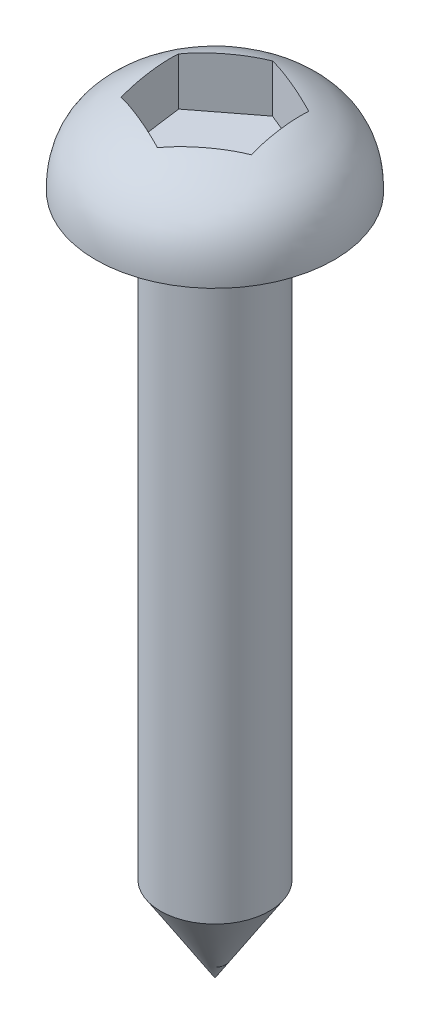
ISO-10303-21;
HEADER;
FILE_DESCRIPTION(('STEP AP214'),'2;1');
FILE_NAME('part.step','',(''),(''),'','','');
FILE_SCHEMA(('AUTOMOTIVE_DESIGN { 1 0 10303 214 1 1 1 1 }'));
ENDSEC;
DATA;
#1=APPLICATION_CONTEXT('core data for automotive mechanical design processes');
#2=APPLICATION_PROTOCOL_DEFINITION('international standard','automotive_design',2000,#1);
#3=PRODUCT_CONTEXT('',#1,'mechanical');
#4=PRODUCT('Part','Part','',(#3));
#5=PRODUCT_RELATED_PRODUCT_CATEGORY('part','',(#4));
#6=PRODUCT_DEFINITION_FORMATION('','',#4);
#7=PRODUCT_DEFINITION_CONTEXT('part definition',#1,'design');
#8=PRODUCT_DEFINITION('design','',#6,#7);
#9=PRODUCT_DEFINITION_SHAPE('','',#8);
#10=(LENGTH_UNIT() NAMED_UNIT(*) SI_UNIT(.MILLI.,.METRE.));
#11=(NAMED_UNIT(*) PLANE_ANGLE_UNIT() SI_UNIT($,.RADIAN.));
#12=(NAMED_UNIT(*) SI_UNIT($,.STERADIAN.) SOLID_ANGLE_UNIT());
#13=UNCERTAINTY_MEASURE_WITH_UNIT(LENGTH_MEASURE(1.E-05),#10,'distance_accuracy_value','');
#14=(GEOMETRIC_REPRESENTATION_CONTEXT(3) GLOBAL_UNCERTAINTY_ASSIGNED_CONTEXT((#13)) GLOBAL_UNIT_ASSIGNED_CONTEXT((#10,
#11,#12)) REPRESENTATION_CONTEXT('',''));
#15=CARTESIAN_POINT('',(0.,0.,0.));
#16=DIRECTION('',(0.,0.,1.));
#17=DIRECTION('',(1.,0.,0.));
#18=AXIS2_PLACEMENT_3D('',#15,#16,#17);
#19=CARTESIAN_POINT('',(0.,8.85,0.));
#20=CARTESIAN_POINT('',(-1.23672619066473,8.83535604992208,0.));
#21=CARTESIAN_POINT('',(-1.69469219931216,8.77485583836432,0.));
#22=CARTESIAN_POINT('',(-2.83177027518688,8.13342718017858,0.));
#23=CARTESIAN_POINT('',(-3.51361897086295,7.67125323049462,0.));
#24=CARTESIAN_POINT('',(-3.5,6.4,0.));
#25=B_SPLINE_CURVE_WITH_KNOTS('',3,(#19,#20,#21,#22,#23,#24),.UNSPECIFIED.,.F.,.F.,(4,2,4),(0.,
0.508645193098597,1.),.UNSPECIFIED.);
#26=CARTESIAN_POINT('',(0.,9.43427916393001,0.));
#27=DIRECTION('',(0.,1.,0.));
#28=AXIS1_PLACEMENT('',#26,#27);
#29=SURFACE_OF_REVOLUTION('',#25,#28);
#30=CARTESIAN_POINT('',(0.,6.4,0.));
#31=DIRECTION('',(0.,1.,0.));
#32=DIRECTION('',(0.,0.,1.));
#33=AXIS2_PLACEMENT_3D('',#30,#31,#32);
#34=CIRCLE('',#33,3.5);
#35=CARTESIAN_POINT('',(0.,6.4,3.5));
#36=VERTEX_POINT('',#35);
#37=EDGE_CURVE('E98',#36,#36,#34,.T.);
#38=ORIENTED_EDGE('',*,*,#37,.T.);
#39=EDGE_LOOP('',(#38));
#40=FACE_BOUND('',#39,.T.);
#41=CARTESIAN_POINT('',(1.55623644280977,8.60199665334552,-1.19643698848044));
#42=CARTESIAN_POINT('',(1.56161786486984,8.61058086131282,-1.15585192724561));
#43=CARTESIAN_POINT('',(1.56701811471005,8.61846530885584,-1.11512487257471));
#44=CARTESIAN_POINT('',(1.57784651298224,8.63291595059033,-1.03346036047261));
#45=CARTESIAN_POINT('',(1.58327464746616,8.63948274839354,-0.99252300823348));
#46=CARTESIAN_POINT('',(1.59412865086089,8.651359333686,-0.910665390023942));
#47=CARTESIAN_POINT('',(1.59955441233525,8.65667483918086,-0.869745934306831));
#48=CARTESIAN_POINT('',(1.61042420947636,8.66617720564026,-0.787769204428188));
#49=CARTESIAN_POINT('',(1.61586824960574,8.67036376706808,-0.746711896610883));
#50=CARTESIAN_POINT('',(1.63728895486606,8.68478112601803,-0.585163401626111));
#51=CARTESIAN_POINT('',(1.65331280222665,8.69108057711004,-0.46431638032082));
#52=CARTESIAN_POINT('',(1.68538240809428,8.6961333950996,-0.22245709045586));
#53=CARTESIAN_POINT('',(1.70142817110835,8.69488485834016,-0.101444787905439));
#54=CARTESIAN_POINT('',(1.72557781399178,8.68707310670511,0.0806845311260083));
#55=CARTESIAN_POINT('',(1.73369878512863,8.68343211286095,0.14193044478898));
#56=CARTESIAN_POINT('',(1.74991746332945,8.67391492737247,0.264246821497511));
#57=CARTESIAN_POINT('',(1.75801517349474,8.66803904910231,0.32531730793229));
#58=CARTESIAN_POINT('',(1.77417212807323,8.65378833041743,0.447168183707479));
#59=CARTESIAN_POINT('',(1.78223137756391,8.64541382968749,0.50794861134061));
#60=CARTESIAN_POINT('',(1.79829487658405,8.62587251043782,0.629094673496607));
#61=CARTESIAN_POINT('',(1.80629909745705,8.61470433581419,0.689460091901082));
#62=CARTESIAN_POINT('',(1.81426304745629,8.60199665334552,0.749521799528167));
#63=B_SPLINE_CURVE_WITH_KNOTS('',3,(#41,#42,#43,#44,#45,#46,#47,#48,#49,#50,#51,#52,#53,#54,#55,
#56,#57,#58,#59,#60,#61,#62),.UNSPECIFIED.,.F.,.F.,(4,2,2,2,2,2,2,2,2,2,4),(0.,
0.125480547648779,0.250903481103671,0.375741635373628,0.500612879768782,0.866512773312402,
1.23250495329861,1.41813964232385,1.60374831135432,1.78933175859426,1.97500546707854),.UNSPECIFIED.);
#64=CARTESIAN_POINT('',(1.55623644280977,8.60199665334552,-1.19643698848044));
#65=VERTEX_POINT('',#64);
#66=CARTESIAN_POINT('',(1.81426304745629,8.60199665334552,0.749521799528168));
#67=VERTEX_POINT('',#66);
#68=EDGE_CURVE('E45',#65,#67,#63,.T.);
#69=ORIENTED_EDGE('',*,*,#68,.T.);
#70=CARTESIAN_POINT('',(1.8142630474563,8.60199665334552,0.749521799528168));
#71=CARTESIAN_POINT('',(1.78180606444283,8.61058086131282,0.774474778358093));
#72=CARTESIAN_POINT('',(1.74923552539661,8.61846530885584,0.799515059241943));
#73=CARTESIAN_POINT('',(1.68392618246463,8.63291595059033,0.849724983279));
#74=CARTESIAN_POINT('',(1.65118746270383,8.63948274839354,0.874894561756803));
#75=CARTESIAN_POINT('',(1.58572368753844,8.651359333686,0.925223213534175));
#76=CARTESIAN_POINT('',(1.55299928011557,8.65667483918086,0.950381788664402));
#77=CARTESIAN_POINT('',(1.48744024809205,8.66617720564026,1.00078367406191));
#78=CARTESIAN_POINT('',(1.45460559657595,8.67036376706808,1.02602700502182));
#79=CARTESIAN_POINT('',(1.32541084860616,8.68478112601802,1.12535212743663));
#80=CARTESIAN_POINT('',(1.22876618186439,8.69108057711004,1.19965269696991));
#81=CARTESIAN_POINT('',(1.03534469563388,8.6961333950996,1.34835543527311));
#82=CARTESIAN_POINT('',(0.938567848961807,8.69488485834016,1.42275762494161));
#83=CARTESIAN_POINT('',(0.792914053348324,8.68707310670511,1.53473648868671));
#84=CARTESIAN_POINT('',(0.74393402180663,8.68343211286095,1.57239241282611));
#85=CARTESIAN_POINT('',(0.646114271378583,8.67391492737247,1.64759638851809));
#86=CARTESIAN_POINT('',(0.597274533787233,8.66803904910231,1.6851444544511));
#87=CARTESIAN_POINT('',(0.499827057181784,8.65378833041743,1.76006222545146));
#88=CARTESIAN_POINT('',(0.45121928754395,8.64541382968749,1.79743195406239));
#89=CARTESIAN_POINT('',(0.354335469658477,8.62587251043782,1.8719163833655));
#90=CARTESIAN_POINT('',(0.306059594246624,8.61470433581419,1.90903095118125));
#91=CARTESIAN_POINT('',(0.258026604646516,8.60199665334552,1.94595878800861));
#92=B_SPLINE_CURVE_WITH_KNOTS('',3,(#70,#71,#72,#73,#74,#75,#76,#77,#78,#79,#80,#81,#82,#83,#84,
#85,#86,#87,#88,#89,#90,#91),.UNSPECIFIED.,.F.,.F.,(4,2,2,2,2,2,2,2,2,2,4),(0.,0.12548054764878,
0.250903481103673,0.375741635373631,0.500612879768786,0.866512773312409,1.23250495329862,
1.41813964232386,1.60374831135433,1.78933175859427,1.97500546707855),.UNSPECIFIED.);
#93=CARTESIAN_POINT('',(0.258026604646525,8.60199665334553,1.9459587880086));
#94=VERTEX_POINT('',#93);
#95=EDGE_CURVE('E11',#67,#94,#92,.T.);
#96=ORIENTED_EDGE('',*,*,#95,.T.);
#97=CARTESIAN_POINT('',(0.25802660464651,8.60199665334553,1.9459587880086));
#98=CARTESIAN_POINT('',(0.220188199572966,8.61058086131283,1.9303267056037));
#99=CARTESIAN_POINT('',(0.182217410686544,8.61846530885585,1.91463993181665));
#100=CARTESIAN_POINT('',(0.106079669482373,8.63291595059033,1.88318534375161));
#101=CARTESIAN_POINT('',(0.0679128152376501,8.63948274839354,1.86741756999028));
#102=CARTESIAN_POINT('',(-0.00840496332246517,8.65135933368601,1.83588860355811));
#103=CARTESIAN_POINT('',(-0.0465551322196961,8.65667483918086,1.82012772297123));
#104=CARTESIAN_POINT('',(-0.12298396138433,8.66617720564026,1.78855287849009));
#105=CARTESIAN_POINT('',(-0.1612626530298,8.67036376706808,1.7727389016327));
#106=CARTESIAN_POINT('',(-0.311878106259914,8.68478112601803,1.71051552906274));
#107=CARTESIAN_POINT('',(-0.424546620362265,8.69108057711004,1.66396907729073));
#108=CARTESIAN_POINT('',(-0.650037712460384,8.69613339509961,1.57081252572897));
#109=CARTESIAN_POINT('',(-0.762860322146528,8.69488485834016,1.52420241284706));
#110=CARTESIAN_POINT('',(-0.932663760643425,8.68707310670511,1.4540519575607));
#111=CARTESIAN_POINT('',(-0.989764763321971,8.68343211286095,1.43046196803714));
#112=CARTESIAN_POINT('',(-1.10380319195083,8.67391492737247,1.38334956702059));
#113=CARTESIAN_POINT('',(-1.16074063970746,8.66803904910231,1.35982714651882));
#114=CARTESIAN_POINT('',(-1.2743450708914,8.65378833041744,1.31289404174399));
#115=CARTESIAN_POINT('',(-1.3310120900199,8.6454138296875,1.2894833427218));
#116=CARTESIAN_POINT('',(-1.44395940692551,8.62587251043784,1.24282170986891));
#117=CARTESIAN_POINT('',(-1.50023950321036,8.6147043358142,1.21957085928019));
#118=CARTESIAN_POINT('',(-1.55623644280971,8.60199665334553,1.19643698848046));
#119=B_SPLINE_CURVE_WITH_KNOTS('',3,(#97,#98,#99,#100,#101,#102,#103,#104,#105,#106,#107,#108,
#109,#110,#111,#112,#113,#114,#115,#116,#117,#118),.UNSPECIFIED.,.F.,.F.,(4,2,2,2,2,2,2,2,2,2,
4),(0.,0.125480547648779,0.250903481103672,0.375741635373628,0.500612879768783,
0.866512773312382,1.23250495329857,1.4181396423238,1.60374831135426,1.78933175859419,
1.97500546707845),.UNSPECIFIED.);
#120=CARTESIAN_POINT('',(-1.5562364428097,8.60199665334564,1.19643698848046));
#121=VERTEX_POINT('',#120);
#122=EDGE_CURVE('E148',#94,#121,#119,.T.);
#123=ORIENTED_EDGE('',*,*,#122,.T.);
#124=CARTESIAN_POINT('',(-1.5562364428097,8.60199665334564,1.19643698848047));
#125=CARTESIAN_POINT('',(-1.56161786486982,8.61058086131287,1.15585192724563));
#126=CARTESIAN_POINT('',(-1.56701811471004,8.61846530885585,1.11512487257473));
#127=CARTESIAN_POINT('',(-1.57784651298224,8.63291595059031,1.03346036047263));
#128=CARTESIAN_POINT('',(-1.58327464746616,8.63948274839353,0.992523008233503));
#129=CARTESIAN_POINT('',(-1.59412865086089,8.651359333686,0.910665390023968));
#130=CARTESIAN_POINT('',(-1.59955441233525,8.65667483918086,0.869745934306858));
#131=CARTESIAN_POINT('',(-1.61042420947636,8.66617720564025,0.787769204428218));
#132=CARTESIAN_POINT('',(-1.61586824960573,8.67036376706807,0.746711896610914));
#133=CARTESIAN_POINT('',(-1.63728895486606,8.68478112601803,0.585163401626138));
#134=CARTESIAN_POINT('',(-1.65331280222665,8.69108057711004,0.464316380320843));
#135=CARTESIAN_POINT('',(-1.68538240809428,8.6961333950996,0.222457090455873));
#136=CARTESIAN_POINT('',(-1.70142817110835,8.69488485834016,0.101444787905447));
#137=CARTESIAN_POINT('',(-1.72557781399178,8.68707310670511,-0.0806845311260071));
#138=CARTESIAN_POINT('',(-1.73369878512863,8.68343211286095,-0.14193044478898));
#139=CARTESIAN_POINT('',(-1.74991746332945,8.67391492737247,-0.264246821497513));
#140=CARTESIAN_POINT('',(-1.75801517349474,8.66803904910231,-0.325317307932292));
#141=CARTESIAN_POINT('',(-1.77417212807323,8.65378833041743,-0.447168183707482));
#142=CARTESIAN_POINT('',(-1.78223137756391,8.64541382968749,-0.507948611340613));
#143=CARTESIAN_POINT('',(-1.79829487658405,8.62587251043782,-0.629094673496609));
#144=CARTESIAN_POINT('',(-1.80629909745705,8.61470433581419,-0.689460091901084));
#145=CARTESIAN_POINT('',(-1.81426304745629,8.60199665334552,-0.749521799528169));
#146=B_SPLINE_CURVE_WITH_KNOTS('',3,(#124,#125,#126,#127,#128,#129,#130,#131,#132,#133,#134,
#135,#136,#137,#138,#139,#140,#141,#142,#143,#144,#145),.UNSPECIFIED.,.F.,.F.,(4,2,2,2,2,2,2,2,
2,2,4),(0.,0.125480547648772,0.250903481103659,0.375741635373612,0.500612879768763,
0.866512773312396,1.23250495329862,1.41813964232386,1.60374831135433,1.78933175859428,
1.97500546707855),.UNSPECIFIED.);
#147=CARTESIAN_POINT('',(-1.81426304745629,8.60199665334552,-0.749521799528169));
#148=VERTEX_POINT('',#147);
#149=EDGE_CURVE('E157',#121,#148,#146,.T.);
#150=ORIENTED_EDGE('',*,*,#149,.T.);
#151=CARTESIAN_POINT('',(-1.81426304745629,8.60199665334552,-0.74952179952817));
#152=CARTESIAN_POINT('',(-1.78180606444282,8.61058086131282,-0.774474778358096));
#153=CARTESIAN_POINT('',(-1.74923552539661,8.61846530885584,-0.799515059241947));
#154=CARTESIAN_POINT('',(-1.68392618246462,8.63291595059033,-0.849724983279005));
#155=CARTESIAN_POINT('',(-1.65118746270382,8.63948274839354,-0.874894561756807));
#156=CARTESIAN_POINT('',(-1.58572368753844,8.651359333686,-0.92522321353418));
#157=CARTESIAN_POINT('',(-1.55299928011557,8.65667483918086,-0.950381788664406));
#158=CARTESIAN_POINT('',(-1.48744024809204,8.66617720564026,-1.00078367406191));
#159=CARTESIAN_POINT('',(-1.45460559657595,8.67036376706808,-1.02602700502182));
#160=CARTESIAN_POINT('',(-1.32541084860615,8.68478112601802,-1.12535212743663));
#161=CARTESIAN_POINT('',(-1.22876618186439,8.69108057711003,-1.19965269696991));
#162=CARTESIAN_POINT('',(-1.03534469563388,8.6961333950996,-1.34835543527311));
#163=CARTESIAN_POINT('',(-0.938567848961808,8.69488485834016,-1.42275762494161));
#164=CARTESIAN_POINT('',(-0.792914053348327,8.68707310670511,-1.5347364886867));
#165=CARTESIAN_POINT('',(-0.743934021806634,8.68343211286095,-1.57239241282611));
#166=CARTESIAN_POINT('',(-0.646114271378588,8.67391492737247,-1.64759638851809));
#167=CARTESIAN_POINT('',(-0.597274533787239,8.66803904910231,-1.68514445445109));
#168=CARTESIAN_POINT('',(-0.499827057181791,8.65378833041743,-1.76006222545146));
#169=CARTESIAN_POINT('',(-0.451219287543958,8.64541382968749,-1.79743195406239));
#170=CARTESIAN_POINT('',(-0.354335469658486,8.62587251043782,-1.87191638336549));
#171=CARTESIAN_POINT('',(-0.306059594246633,8.61470433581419,-1.90903095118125));
#172=CARTESIAN_POINT('',(-0.258026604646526,8.60199665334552,-1.94595878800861));
#173=B_SPLINE_CURVE_WITH_KNOTS('',3,(#151,#152,#153,#154,#155,#156,#157,#158,#159,#160,#161,
#162,#163,#164,#165,#166,#167,#168,#169,#170,#171,#172),.UNSPECIFIED.,.F.,.F.,(4,2,2,2,2,2,2,2,
2,2,4),(0.,0.12548054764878,0.250903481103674,0.375741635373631,0.500612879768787,
0.866512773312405,1.23250495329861,1.41813964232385,1.60374831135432,1.78933175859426,
1.97500546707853),.UNSPECIFIED.);
#174=CARTESIAN_POINT('',(-0.258026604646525,8.60199665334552,-1.94595878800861));
#175=VERTEX_POINT('',#174);
#176=EDGE_CURVE('E164',#148,#175,#173,.T.);
#177=ORIENTED_EDGE('',*,*,#176,.T.);
#178=CARTESIAN_POINT('',(-0.258026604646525,8.60199665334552,-1.94595878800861));
#179=CARTESIAN_POINT('',(-0.22018819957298,8.61058086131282,-1.93032670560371));
#180=CARTESIAN_POINT('',(-0.182217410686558,8.61846530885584,-1.91463993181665));
#181=CARTESIAN_POINT('',(-0.106079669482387,8.63291595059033,-1.88318534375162));
#182=CARTESIAN_POINT('',(-0.0679128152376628,8.63948274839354,-1.86741756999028));
#183=CARTESIAN_POINT('',(0.00840496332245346,8.651359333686,-1.83588860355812));
#184=CARTESIAN_POINT('',(0.0465551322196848,8.65667483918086,-1.82012772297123));
#185=CARTESIAN_POINT('',(0.122983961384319,8.66617720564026,-1.78855287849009));
#186=CARTESIAN_POINT('',(0.161262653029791,8.67036376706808,-1.7727389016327));
#187=CARTESIAN_POINT('',(0.311878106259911,8.68478112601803,-1.71051552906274));
#188=CARTESIAN_POINT('',(0.424546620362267,8.69108057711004,-1.66396907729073));
#189=CARTESIAN_POINT('',(0.650037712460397,8.69613339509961,-1.57081252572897));
#190=CARTESIAN_POINT('',(0.762860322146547,8.69488485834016,-1.52420241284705));
#191=CARTESIAN_POINT('',(0.932663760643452,8.68707310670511,-1.45405195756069));
#192=CARTESIAN_POINT('',(0.989764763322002,8.68343211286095,-1.43046196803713));
#193=CARTESIAN_POINT('',(1.10380319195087,8.67391492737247,-1.38334956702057));
#194=CARTESIAN_POINT('',(1.1607406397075,8.66803904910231,-1.3598271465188));
#195=CARTESIAN_POINT('',(1.27434507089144,8.65378833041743,-1.31289404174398));
#196=CARTESIAN_POINT('',(1.33101209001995,8.64541382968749,-1.28948334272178));
#197=CARTESIAN_POINT('',(1.44395940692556,8.62587251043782,-1.24282170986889));
#198=CARTESIAN_POINT('',(1.50023950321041,8.61470433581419,-1.21957085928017));
#199=CARTESIAN_POINT('',(1.55623644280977,8.60199665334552,-1.19643698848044));
#200=B_SPLINE_CURVE_WITH_KNOTS('',3,(#178,#179,#180,#181,#182,#183,#184,#185,#186,#187,#188,
#189,#190,#191,#192,#193,#194,#195,#196,#197,#198,#199),.UNSPECIFIED.,.F.,.F.,(4,2,2,2,2,2,2,2,
2,2,4),(0.,0.125480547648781,0.250903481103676,0.375741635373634,0.50061287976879,
0.866512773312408,1.23250495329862,1.41813964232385,1.60374831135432,1.78933175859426,
1.97500546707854),.UNSPECIFIED.);
#201=EDGE_CURVE('E170',#175,#65,#200,.T.);
#202=ORIENTED_EDGE('',*,*,#201,.T.);
#203=EDGE_LOOP('',(#69,#96,#123,#150,#177,#202));
#204=FACE_BOUND('',#203,.T.);
#205=ADVANCED_FACE('F32',(#40,#204),#29,.F.);
#206=CARTESIAN_POINT('',(0.,-13.6,0.));
#207=DIRECTION('',(0.,1.,0.));
#208=DIRECTION('',(0.,0.,1.));
#209=AXIS2_PLACEMENT_3D('',#206,#207,#208);
#210=CYLINDRICAL_SURFACE('',#209,1.6);
#211=CARTESIAN_POINT('',(0.,-11.1,0.));
#212=DIRECTION('',(0.,1.,0.));
#213=DIRECTION('',(0.,0.,1.));
#214=AXIS2_PLACEMENT_3D('',#211,#212,#213);
#215=CIRCLE('',#214,1.6);
#216=CARTESIAN_POINT('',(0.,-11.1,1.6));
#217=VERTEX_POINT('',#216);
#218=EDGE_CURVE('E195',#217,#217,#215,.T.);
#219=ORIENTED_EDGE('',*,*,#218,.T.);
#220=EDGE_LOOP('',(#219));
#221=FACE_BOUND('',#220,.T.);
#222=CARTESIAN_POINT('',(0.,6.4,0.));
#223=DIRECTION('',(0.,1.,0.));
#224=DIRECTION('',(0.,0.,1.));
#225=AXIS2_PLACEMENT_3D('',#222,#223,#224);
#226=CIRCLE('',#225,1.6);
#227=CARTESIAN_POINT('',(0.,6.4,1.6));
#228=VERTEX_POINT('',#227);
#229=EDGE_CURVE('E197',#228,#228,#226,.T.);
#230=ORIENTED_EDGE('',*,*,#229,.F.);
#231=EDGE_LOOP('',(#230));
#232=FACE_BOUND('',#231,.T.);
#233=ADVANCED_FACE('F142',(#221,#232),#210,.T.);
#234=CARTESIAN_POINT('',(0.,6.4,0.));
#235=DIRECTION('',(0.,-1.,0.));
#236=DIRECTION('',(0.,0.,-1.));
#237=AXIS2_PLACEMENT_3D('',#234,#235,#236);
#238=PLANE('',#237);
#239=ORIENTED_EDGE('',*,*,#229,.T.);
#240=EDGE_LOOP('',(#239));
#241=FACE_BOUND('',#240,.T.);
#242=ORIENTED_EDGE('',*,*,#37,.F.);
#243=EDGE_LOOP('',(#242));
#244=FACE_BOUND('',#243,.T.);
#245=ADVANCED_FACE('F144',(#241,#244),#238,.T.);
#246=CARTESIAN_POINT('',(0.,-11.1,0.));
#247=DIRECTION('',(0.,1.,0.));
#248=DIRECTION('',(0.,0.,1.));
#249=AXIS2_PLACEMENT_3D('',#246,#247,#248);
#250=CONICAL_SURFACE('',#249,1.6,0.56931319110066);
#251=CARTESIAN_POINT('',(0.,-13.6,0.));
#252=VERTEX_POINT('',#251);
#253=VERTEX_LOOP('',#252);
#254=FACE_BOUND('',#253,.T.);
#255=ORIENTED_EDGE('',*,*,#218,.F.);
#256=EDGE_LOOP('',(#255));
#257=FACE_BOUND('',#256,.T.);
#258=ADVANCED_FACE('F34',(#254,#257),#250,.T.);
#259=CARTESIAN_POINT('',(0.258026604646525,9.2,1.9459587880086));
#260=DIRECTION('',(-0.609496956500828,0.,-0.792788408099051));
#261=DIRECTION('',(-0.792788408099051,0.,0.609496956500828));
#262=AXIS2_PLACEMENT_3D('',#259,#260,#261);
#263=PLANE('',#262);
#264=DIRECTION('',(0.,-1.,0.));
#265=VECTOR('',#264,1.);
#266=CARTESIAN_POINT('',(1.81426304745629,9.2,0.749521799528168));
#267=LINE('',#266,#265);
#268=CARTESIAN_POINT('',(1.81426304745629,7.2,0.749521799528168));
#269=VERTEX_POINT('',#268);
#270=EDGE_CURVE('E90',#67,#269,#267,.T.);
#271=ORIENTED_EDGE('',*,*,#270,.T.);
#272=DIRECTION('',(0.792788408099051,0.,-0.609496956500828));
#273=VECTOR('',#272,1.);
#274=CARTESIAN_POINT('',(0.258026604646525,7.2,1.9459587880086));
#275=LINE('',#274,#273);
#276=CARTESIAN_POINT('',(0.258026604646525,7.2,1.9459587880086));
#277=VERTEX_POINT('',#276);
#278=EDGE_CURVE('E95',#277,#269,#275,.T.);
#279=ORIENTED_EDGE('',*,*,#278,.F.);
#280=DIRECTION('',(0.,-1.,0.));
#281=VECTOR('',#280,1.);
#282=CARTESIAN_POINT('',(0.258026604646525,9.2,1.9459587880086));
#283=LINE('',#282,#281);
#284=EDGE_CURVE('E123',#94,#277,#283,.T.);
#285=ORIENTED_EDGE('',*,*,#284,.F.);
#286=ORIENTED_EDGE('',*,*,#95,.F.);
#287=EDGE_LOOP('',(#271,#279,#285,#286));
#288=FACE_BOUND('',#287,.T.);
#289=ADVANCED_FACE('F92',(#288),#263,.T.);
#290=CARTESIAN_POINT('',(1.81426304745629,9.2,0.749521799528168));
#291=DIRECTION('',(-0.991323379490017,0.,0.131445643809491));
#292=DIRECTION('',(0.131445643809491,0.,0.991323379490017));
#293=AXIS2_PLACEMENT_3D('',#290,#291,#292);
#294=PLANE('',#293);
#295=DIRECTION('',(0.,-1.,0.));
#296=VECTOR('',#295,1.);
#297=CARTESIAN_POINT('',(1.55623644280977,9.2,-1.19643698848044));
#298=LINE('',#297,#296);
#299=CARTESIAN_POINT('',(1.55623644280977,7.2,-1.19643698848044));
#300=VERTEX_POINT('',#299);
#301=EDGE_CURVE('E99',#65,#300,#298,.T.);
#302=ORIENTED_EDGE('',*,*,#301,.T.);
#303=DIRECTION('',(-0.131445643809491,0.,-0.991323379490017));
#304=VECTOR('',#303,1.);
#305=CARTESIAN_POINT('',(1.81426304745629,7.2,0.749521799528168));
#306=LINE('',#305,#304);
#307=EDGE_CURVE('E102',#269,#300,#306,.T.);
#308=ORIENTED_EDGE('',*,*,#307,.F.);
#309=ORIENTED_EDGE('',*,*,#270,.F.);
#310=ORIENTED_EDGE('',*,*,#68,.F.);
#311=EDGE_LOOP('',(#302,#308,#309,#310));
#312=FACE_BOUND('',#311,.T.);
#313=ADVANCED_FACE('F103',(#312),#294,.T.);
#314=CARTESIAN_POINT('',(1.55623644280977,9.2,-1.19643698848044));
#315=DIRECTION('',(-0.381826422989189,0.,0.924234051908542));
#316=DIRECTION('',(0.924234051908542,0.,0.381826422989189));
#317=AXIS2_PLACEMENT_3D('',#314,#315,#316);
#318=PLANE('',#317);
#319=DIRECTION('',(0.,-1.,0.));
#320=VECTOR('',#319,1.);
#321=CARTESIAN_POINT('',(-0.258026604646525,9.2,-1.94595878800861));
#322=LINE('',#321,#320);
#323=CARTESIAN_POINT('',(-0.258026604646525,7.2,-1.94595878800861));
#324=VERTEX_POINT('',#323);
#325=EDGE_CURVE('E128',#175,#324,#322,.T.);
#326=ORIENTED_EDGE('',*,*,#325,.T.);
#327=DIRECTION('',(-0.924234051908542,0.,-0.381826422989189));
#328=VECTOR('',#327,1.);
#329=CARTESIAN_POINT('',(1.55623644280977,7.2,-1.19643698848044));
#330=LINE('',#329,#328);
#331=EDGE_CURVE('E108',#300,#324,#330,.T.);
#332=ORIENTED_EDGE('',*,*,#331,.F.);
#333=ORIENTED_EDGE('',*,*,#301,.F.);
#334=ORIENTED_EDGE('',*,*,#201,.F.);
#335=EDGE_LOOP('',(#326,#332,#333,#334));
#336=FACE_BOUND('',#335,.T.);
#337=ADVANCED_FACE('F181',(#336),#318,.T.);
#338=CARTESIAN_POINT('',(-0.258026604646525,9.2,-1.94595878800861));
#339=DIRECTION('',(0.609496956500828,0.,0.792788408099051));
#340=DIRECTION('',(0.792788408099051,0.,-0.609496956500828));
#341=AXIS2_PLACEMENT_3D('',#338,#339,#340);
#342=PLANE('',#341);
#343=DIRECTION('',(0.,-1.,0.));
#344=VECTOR('',#343,1.);
#345=CARTESIAN_POINT('',(-1.81426304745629,9.2,-0.749521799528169));
#346=LINE('',#345,#344);
#347=CARTESIAN_POINT('',(-1.81426304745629,7.2,-0.749521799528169));
#348=VERTEX_POINT('',#347);
#349=EDGE_CURVE('E126',#148,#348,#346,.T.);
#350=ORIENTED_EDGE('',*,*,#349,.T.);
#351=DIRECTION('',(-0.792788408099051,0.,0.609496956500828));
#352=VECTOR('',#351,1.);
#353=CARTESIAN_POINT('',(-0.258026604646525,7.2,-1.94595878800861));
#354=LINE('',#353,#352);
#355=EDGE_CURVE('E117',#324,#348,#354,.T.);
#356=ORIENTED_EDGE('',*,*,#355,.F.);
#357=ORIENTED_EDGE('',*,*,#325,.F.);
#358=ORIENTED_EDGE('',*,*,#176,.F.);
#359=EDGE_LOOP('',(#350,#356,#357,#358));
#360=FACE_BOUND('',#359,.T.);
#361=ADVANCED_FACE('F212',(#360),#342,.T.);
#362=CARTESIAN_POINT('',(-1.81426304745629,9.2,-0.749521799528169));
#363=DIRECTION('',(0.991323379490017,0.,-0.131445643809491));
#364=DIRECTION('',(-0.131445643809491,0.,-0.991323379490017));
#365=AXIS2_PLACEMENT_3D('',#362,#363,#364);
#366=PLANE('',#365);
#367=DIRECTION('',(0.,-1.,0.));
#368=VECTOR('',#367,1.);
#369=CARTESIAN_POINT('',(-1.55623644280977,9.2,1.19643698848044));
#370=LINE('',#369,#368);
#371=CARTESIAN_POINT('',(-1.55623644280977,7.2,1.19643698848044));
#372=VERTEX_POINT('',#371);
#373=EDGE_CURVE('E52',#121,#372,#370,.T.);
#374=ORIENTED_EDGE('',*,*,#373,.T.);
#375=DIRECTION('',(0.131445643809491,0.,0.991323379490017));
#376=VECTOR('',#375,1.);
#377=CARTESIAN_POINT('',(-1.81426304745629,7.2,-0.749521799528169));
#378=LINE('',#377,#376);
#379=EDGE_CURVE('E120',#348,#372,#378,.T.);
#380=ORIENTED_EDGE('',*,*,#379,.F.);
#381=ORIENTED_EDGE('',*,*,#349,.F.);
#382=ORIENTED_EDGE('',*,*,#149,.F.);
#383=EDGE_LOOP('',(#374,#380,#381,#382));
#384=FACE_BOUND('',#383,.T.);
#385=ADVANCED_FACE('F216',(#384),#366,.T.);
#386=CARTESIAN_POINT('',(-1.55623644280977,9.2,1.19643698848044));
#387=DIRECTION('',(0.381826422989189,0.,-0.924234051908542));
#388=DIRECTION('',(-0.924234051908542,0.,-0.381826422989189));
#389=AXIS2_PLACEMENT_3D('',#386,#387,#388);
#390=PLANE('',#389);
#391=ORIENTED_EDGE('',*,*,#284,.T.);
#392=DIRECTION('',(0.924234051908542,0.,0.381826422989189));
#393=VECTOR('',#392,1.);
#394=CARTESIAN_POINT('',(-1.55623644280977,7.2,1.19643698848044));
#395=LINE('',#394,#393);
#396=EDGE_CURVE('E113',#372,#277,#395,.T.);
#397=ORIENTED_EDGE('',*,*,#396,.F.);
#398=ORIENTED_EDGE('',*,*,#373,.F.);
#399=ORIENTED_EDGE('',*,*,#122,.F.);
#400=EDGE_LOOP('',(#391,#397,#398,#399));
#401=FACE_BOUND('',#400,.T.);
#402=ADVANCED_FACE('F217',(#401),#390,.T.);
#403=CARTESIAN_POINT('',(0.,7.2,0.));
#404=DIRECTION('',(0.,1.,0.));
#405=DIRECTION('',(0.,0.,1.));
#406=AXIS2_PLACEMENT_3D('',#403,#404,#405);
#407=PLANE('',#406);
#408=ORIENTED_EDGE('',*,*,#278,.T.);
#409=ORIENTED_EDGE('',*,*,#307,.T.);
#410=ORIENTED_EDGE('',*,*,#331,.T.);
#411=ORIENTED_EDGE('',*,*,#355,.T.);
#412=ORIENTED_EDGE('',*,*,#379,.T.);
#413=ORIENTED_EDGE('',*,*,#396,.T.);
#414=EDGE_LOOP('',(#408,#409,#410,#411,#412,#413));
#415=FACE_BOUND('',#414,.T.);
#416=ADVANCED_FACE('F111',(#415),#407,.T.);
#417=CLOSED_SHELL('',(#205,#233,#245,#258,#289,#313,#337,#361,#385,#402,#416));
#418=MANIFOLD_SOLID_BREP('B2',#417);
#419=ADVANCED_BREP_SHAPE_REPRESENTATION('',(#18,#418),#14);
#420=SHAPE_DEFINITION_REPRESENTATION(#9,#419);
ENDSEC;
END-ISO-10303-21;
